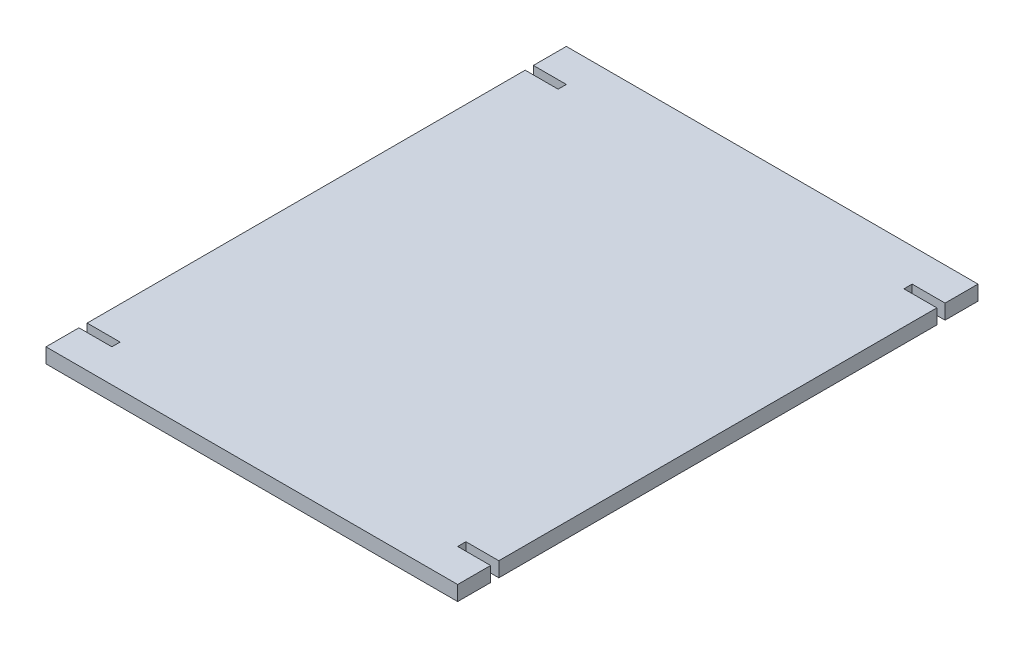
from build123d import *

# Parameters (mm, degrees)
BOSS_EXTRUDE1_DEPTH = 18


with BuildPart() as part:
    # Sketch1 → Boss-Extrude1 (new body)
    with BuildSketch(Plane(origin=(0, 0, 0), x_dir=(1, 0, 0), z_dir=(0, 1, 0))):
        Polygon((-301.875, 208.229166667), (198.125, 208.229166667), (198.125, 168.229166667), (158.125, 168.229166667), (158.125, 158.229166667), (198.125, 158.229166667), (198.125, -373.770833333), (158.125, -373.770833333), (158.125, -383.770833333), (198.125, -383.770833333), (198.125, -423.770833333), (-301.875, -423.770833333), (-301.875, -383.770833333), (-261.875, -383.770833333), (-261.875, -373.770833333), (-301.875, -373.770833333), (-301.875, 158.229166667), (-261.875, 158.229166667), (-261.875, 168.229166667), (-301.875, 168.229166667), align=None)
    extrude(amount=BOSS_EXTRUDE1_DEPTH)


solid = part.part
